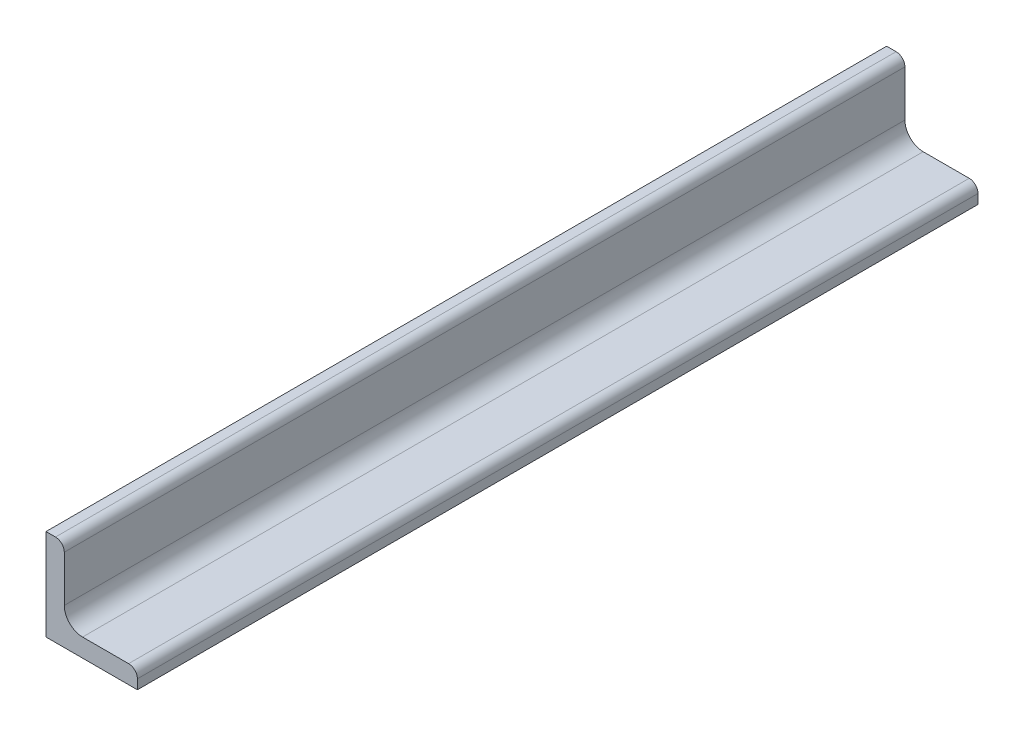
from build123d import *

# Parameters (mm, degrees)
BASESTEELANGLE_DEPTH = 115
TOEFILLET_R          = 2.4


with BuildPart() as part:
    # Sketch1 → BaseSteelAngle (new, symmetric)
    with BuildSketch(Plane.XY):
        with BuildLine():
            Line((0, 25), (0, 0))
            Line((0, 0), (25, 0))
            Line((25, 0), (25, 5))
            Line((25, 5), (10, 5))
            ThreePointArc((10, 5), (6.464466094, 6.464466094), (5, 10))
            Line((5, 10), (5, 25))
            Line((5, 25), (0, 25))
        make_face()
    extrude(amount=BASESTEELANGLE_DEPTH, both=True)

    # ToeFillet
    toefillet_edges = [part.edges().sort_by_distance(p)[0] for p in [
        (5, 25, 0),
        (25, 5, 0),
    ]]
    fillet(toefillet_edges, radius=TOEFILLET_R)


solid = part.part
